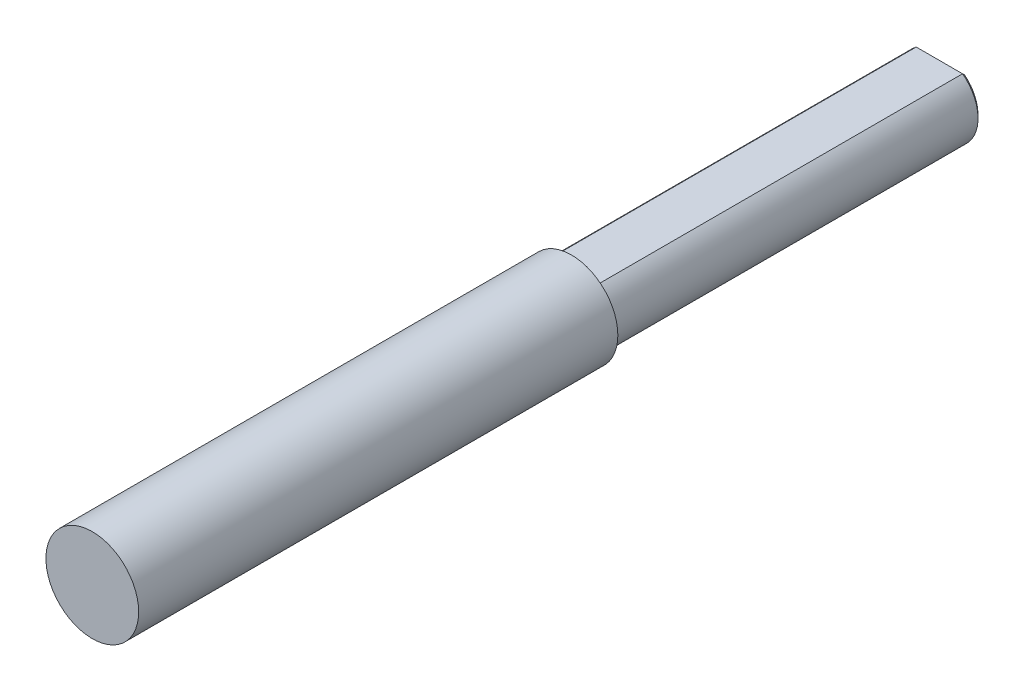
ISO-10303-21;
HEADER;
FILE_DESCRIPTION(('STEP AP214'),'2;1');
FILE_NAME('part.step','',(''),(''),'','','');
FILE_SCHEMA(('AUTOMOTIVE_DESIGN { 1 0 10303 214 1 1 1 1 }'));
ENDSEC;
DATA;
#1=APPLICATION_CONTEXT('core data for automotive mechanical design processes');
#2=APPLICATION_PROTOCOL_DEFINITION('international standard','automotive_design',2000,#1);
#3=PRODUCT_CONTEXT('',#1,'mechanical');
#4=PRODUCT('Part','Part','',(#3));
#5=PRODUCT_RELATED_PRODUCT_CATEGORY('part','',(#4));
#6=PRODUCT_DEFINITION_FORMATION('','',#4);
#7=PRODUCT_DEFINITION_CONTEXT('part definition',#1,'design');
#8=PRODUCT_DEFINITION('design','',#6,#7);
#9=PRODUCT_DEFINITION_SHAPE('','',#8);
#10=(LENGTH_UNIT() NAMED_UNIT(*) SI_UNIT(.MILLI.,.METRE.));
#11=(NAMED_UNIT(*) PLANE_ANGLE_UNIT() SI_UNIT($,.RADIAN.));
#12=(NAMED_UNIT(*) SI_UNIT($,.STERADIAN.) SOLID_ANGLE_UNIT());
#13=UNCERTAINTY_MEASURE_WITH_UNIT(LENGTH_MEASURE(1.E-05),#10,'distance_accuracy_value','');
#14=(GEOMETRIC_REPRESENTATION_CONTEXT(3) GLOBAL_UNCERTAINTY_ASSIGNED_CONTEXT((#13)) GLOBAL_UNIT_ASSIGNED_CONTEXT((#10,
#11,#12)) REPRESENTATION_CONTEXT('',''));
#15=CARTESIAN_POINT('',(0.,0.,0.));
#16=DIRECTION('',(0.,0.,1.));
#17=DIRECTION('',(1.,0.,0.));
#18=AXIS2_PLACEMENT_3D('',#15,#16,#17);
#19=CARTESIAN_POINT('',(0.,0.,47.));
#20=DIRECTION('',(0.,0.,-1.));
#21=DIRECTION('',(-1.,0.,0.));
#22=AXIS2_PLACEMENT_3D('',#19,#20,#21);
#23=CYLINDRICAL_SURFACE('',#22,2.5);
#24=CARTESIAN_POINT('',(0.,0.,24.));
#25=DIRECTION('',(0.,0.,1.));
#26=DIRECTION('',(1.,0.,0.));
#27=AXIS2_PLACEMENT_3D('',#24,#25,#26);
#28=CIRCLE('',#27,2.5);
#29=CARTESIAN_POINT('',(-1.5,2.,24.));
#30=VERTEX_POINT('',#29);
#31=CARTESIAN_POINT('',(1.5,2.,24.));
#32=VERTEX_POINT('',#31);
#33=EDGE_CURVE('E80',#30,#32,#28,.T.);
#34=ORIENTED_EDGE('',*,*,#33,.F.);
#35=DIRECTION('',(0.,0.,-1.));
#36=VECTOR('',#35,1.);
#37=CARTESIAN_POINT('',(-1.5,2.,47.));
#38=LINE('',#37,#36);
#39=CARTESIAN_POINT('',(-1.5,2.,0.199999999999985));
#40=VERTEX_POINT('',#39);
#41=EDGE_CURVE('E68',#30,#40,#38,.T.);
#42=ORIENTED_EDGE('',*,*,#41,.T.);
#43=CARTESIAN_POINT('',(0.,0.,0.199999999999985));
#44=DIRECTION('',(0.,0.,1.));
#45=DIRECTION('',(1.,0.,0.));
#46=AXIS2_PLACEMENT_3D('',#43,#44,#45);
#47=CIRCLE('',#46,2.5);
#48=CARTESIAN_POINT('',(1.5,2.,0.199999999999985));
#49=VERTEX_POINT('',#48);
#50=EDGE_CURVE('E44',#40,#49,#47,.T.);
#51=ORIENTED_EDGE('',*,*,#50,.T.);
#52=DIRECTION('',(0.,0.,-1.));
#53=VECTOR('',#52,1.);
#54=CARTESIAN_POINT('',(1.5,2.,47.));
#55=LINE('',#54,#53);
#56=EDGE_CURVE('E76',#32,#49,#55,.T.);
#57=ORIENTED_EDGE('',*,*,#56,.F.);
#58=EDGE_LOOP('',(#34,#42,#51,#57));
#59=FACE_BOUND('',#58,.T.);
#60=ADVANCED_FACE('F35',(#59),#23,.T.);
#61=CARTESIAN_POINT('',(-1.5,2.,47.));
#62=DIRECTION('',(0.,-1.,0.));
#63=DIRECTION('',(0.,0.,-1.));
#64=AXIS2_PLACEMENT_3D('',#61,#62,#63);
#65=PLANE('',#64);
#66=DIRECTION('',(-1.,0.,0.));
#67=VECTOR('',#66,1.);
#68=CARTESIAN_POINT('',(-1.5,2.,24.));
#69=LINE('',#68,#67);
#70=EDGE_CURVE('E11',#32,#30,#69,.T.);
#71=ORIENTED_EDGE('',*,*,#70,.F.);
#72=ORIENTED_EDGE('',*,*,#56,.T.);
#73=DIRECTION('',(-1.,0.,0.));
#74=VECTOR('',#73,1.);
#75=CARTESIAN_POINT('',(-1.5,2.,0.199999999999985));
#76=LINE('',#75,#74);
#77=EDGE_CURVE('E72',#49,#40,#76,.T.);
#78=ORIENTED_EDGE('',*,*,#77,.T.);
#79=ORIENTED_EDGE('',*,*,#41,.F.);
#80=EDGE_LOOP('',(#71,#72,#78,#79));
#81=FACE_BOUND('',#80,.T.);
#82=ADVANCED_FACE('F70',(#81),#65,.F.);
#83=CARTESIAN_POINT('',(0.,0.,0.));
#84=DIRECTION('',(0.,0.,1.));
#85=DIRECTION('',(1.,0.,0.));
#86=AXIS2_PLACEMENT_3D('',#83,#84,#85);
#87=PLANE('',#86);
#88=CARTESIAN_POINT('',(0.,0.,0.));
#89=DIRECTION('',(0.,0.,1.));
#90=DIRECTION('',(1.,0.,0.));
#91=AXIS2_PLACEMENT_3D('',#88,#89,#90);
#92=CIRCLE('',#91,2.30000000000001);
#93=CARTESIAN_POINT('',(1.43178210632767,1.79999999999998,0.));
#94=VERTEX_POINT('',#93);
#95=CARTESIAN_POINT('',(-1.43178210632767,1.79999999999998,0.));
#96=VERTEX_POINT('',#95);
#97=EDGE_CURVE('E56',#94,#96,#92,.F.);
#98=ORIENTED_EDGE('',*,*,#97,.T.);
#99=DIRECTION('',(1.,0.,0.));
#100=VECTOR('',#99,1.);
#101=CARTESIAN_POINT('',(0.,1.80000000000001,0.));
#102=LINE('',#101,#100);
#103=EDGE_CURVE('E124',#96,#94,#102,.T.);
#104=ORIENTED_EDGE('',*,*,#103,.T.);
#105=EDGE_LOOP('',(#98,#104));
#106=FACE_BOUND('',#105,.T.);
#107=ADVANCED_FACE('F106',(#106),#87,.F.);
#108=CARTESIAN_POINT('',(0.,0.,0.199999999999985));
#109=DIRECTION('',(0.,0.,1.));
#110=DIRECTION('',(1.,0.,0.));
#111=AXIS2_PLACEMENT_3D('',#108,#109,#110);
#112=CONICAL_SURFACE('',#111,2.5,0.78539816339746);
#113=CARTESIAN_POINT('',(-1.5,2.,0.199999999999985));
#114=CARTESIAN_POINT('',(-1.4888803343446,1.96662404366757,0.166624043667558));
#115=CARTESIAN_POINT('',(-1.47763567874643,1.93326940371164,0.133269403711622));
#116=CARTESIAN_POINT('',(-1.45489638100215,1.86660273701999,0.0666027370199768));
#117=CARTESIAN_POINT('',(-1.44340173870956,1.83329071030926,0.0332907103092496));
#118=CARTESIAN_POINT('',(-1.43178210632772,1.80000000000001,0.));
#119=B_SPLINE_CURVE_WITH_KNOTS('',3,(#113,#114,#115,#116,#117,#118),.UNSPECIFIED.,.F.,.F.,(4,2,
4),(0.,0.145476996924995,0.290954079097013),.UNSPECIFIED.);
#120=EDGE_CURVE('E82',#96,#40,#119,.F.);
#121=ORIENTED_EDGE('',*,*,#120,.F.);
#122=ORIENTED_EDGE('',*,*,#97,.F.);
#123=CARTESIAN_POINT('',(1.4317821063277,1.80000000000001,0.));
#124=CARTESIAN_POINT('',(1.44340173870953,1.83329071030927,0.0332907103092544));
#125=CARTESIAN_POINT('',(1.45489638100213,1.86660273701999,0.06660273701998));
#126=CARTESIAN_POINT('',(1.47763567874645,1.93326940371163,0.133269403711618));
#127=CARTESIAN_POINT('',(1.48888033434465,1.96662404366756,0.166624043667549));
#128=CARTESIAN_POINT('',(1.50000000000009,1.99999999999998,0.199999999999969));
#129=B_SPLINE_CURVE_WITH_KNOTS('',3,(#123,#124,#125,#126,#127,#128),.UNSPECIFIED.,.F.,.F.,(4,2,
4),(0.,0.145477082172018,0.290954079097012),.UNSPECIFIED.);
#130=EDGE_CURVE('E77',#49,#94,#129,.F.);
#131=ORIENTED_EDGE('',*,*,#130,.F.);
#132=ORIENTED_EDGE('',*,*,#50,.F.);
#133=EDGE_LOOP('',(#121,#122,#131,#132));
#134=FACE_BOUND('',#133,.T.);
#135=ADVANCED_FACE('F97',(#134),#112,.T.);
#136=CARTESIAN_POINT('',(-1.5,2.,0.199999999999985));
#137=DIRECTION('',(0.,-0.707106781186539,0.707106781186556));
#138=DIRECTION('',(-1.,0.,0.));
#139=AXIS2_PLACEMENT_3D('',#136,#137,#138);
#140=PLANE('',#139);
#141=ORIENTED_EDGE('',*,*,#130,.T.);
#142=ORIENTED_EDGE('',*,*,#103,.F.);
#143=ORIENTED_EDGE('',*,*,#120,.T.);
#144=ORIENTED_EDGE('',*,*,#77,.F.);
#145=EDGE_LOOP('',(#141,#142,#143,#144));
#146=FACE_BOUND('',#145,.T.);
#147=ADVANCED_FACE('F37',(#146),#140,.F.);
#148=CARTESIAN_POINT('',(0.,0.,24.));
#149=DIRECTION('',(0.,0.,1.));
#150=DIRECTION('',(1.,0.,0.));
#151=AXIS2_PLACEMENT_3D('',#148,#149,#150);
#152=PLANE('',#151);
#153=CARTESIAN_POINT('',(0.,0.,24.));
#154=DIRECTION('',(0.,0.,1.));
#155=DIRECTION('',(1.,0.,0.));
#156=AXIS2_PLACEMENT_3D('',#153,#154,#155);
#157=CIRCLE('',#156,3.);
#158=CARTESIAN_POINT('',(3.,0.,24.));
#159=VERTEX_POINT('',#158);
#160=EDGE_CURVE('E83',#159,#159,#157,.T.);
#161=ORIENTED_EDGE('',*,*,#160,.F.);
#162=EDGE_LOOP('',(#161));
#163=FACE_BOUND('',#162,.T.);
#164=ORIENTED_EDGE('',*,*,#70,.T.);
#165=ORIENTED_EDGE('',*,*,#33,.T.);
#166=EDGE_LOOP('',(#164,#165));
#167=FACE_BOUND('',#166,.T.);
#168=ADVANCED_FACE('F85',(#163,#167),#152,.F.);
#169=CARTESIAN_POINT('',(0.,0.,24.));
#170=DIRECTION('',(0.,0.,1.));
#171=DIRECTION('',(1.,0.,0.));
#172=AXIS2_PLACEMENT_3D('',#169,#170,#171);
#173=CYLINDRICAL_SURFACE('',#172,3.);
#174=ORIENTED_EDGE('',*,*,#160,.T.);
#175=EDGE_LOOP('',(#174));
#176=FACE_BOUND('',#175,.T.);
#177=CARTESIAN_POINT('',(0.,0.,55.));
#178=DIRECTION('',(0.,0.,1.));
#179=DIRECTION('',(1.,0.,0.));
#180=AXIS2_PLACEMENT_3D('',#177,#178,#179);
#181=CIRCLE('',#180,3.);
#182=CARTESIAN_POINT('',(3.,0.,55.));
#183=VERTEX_POINT('',#182);
#184=EDGE_CURVE('E132',#183,#183,#181,.T.);
#185=ORIENTED_EDGE('',*,*,#184,.F.);
#186=EDGE_LOOP('',(#185));
#187=FACE_BOUND('',#186,.T.);
#188=ADVANCED_FACE('F87',(#176,#187),#173,.T.);
#189=CARTESIAN_POINT('',(0.,0.,55.));
#190=DIRECTION('',(0.,0.,1.));
#191=DIRECTION('',(1.,0.,0.));
#192=AXIS2_PLACEMENT_3D('',#189,#190,#191);
#193=PLANE('',#192);
#194=ORIENTED_EDGE('',*,*,#184,.T.);
#195=EDGE_LOOP('',(#194));
#196=FACE_BOUND('',#195,.T.);
#197=ADVANCED_FACE('F94',(#196),#193,.T.);
#198=CLOSED_SHELL('',(#60,#82,#107,#135,#147,#168,#188,#197));
#199=MANIFOLD_SOLID_BREP('B2',#198);
#200=ADVANCED_BREP_SHAPE_REPRESENTATION('',(#18,#199),#14);
#201=SHAPE_DEFINITION_REPRESENTATION(#9,#200);
ENDSEC;
END-ISO-10303-21;
